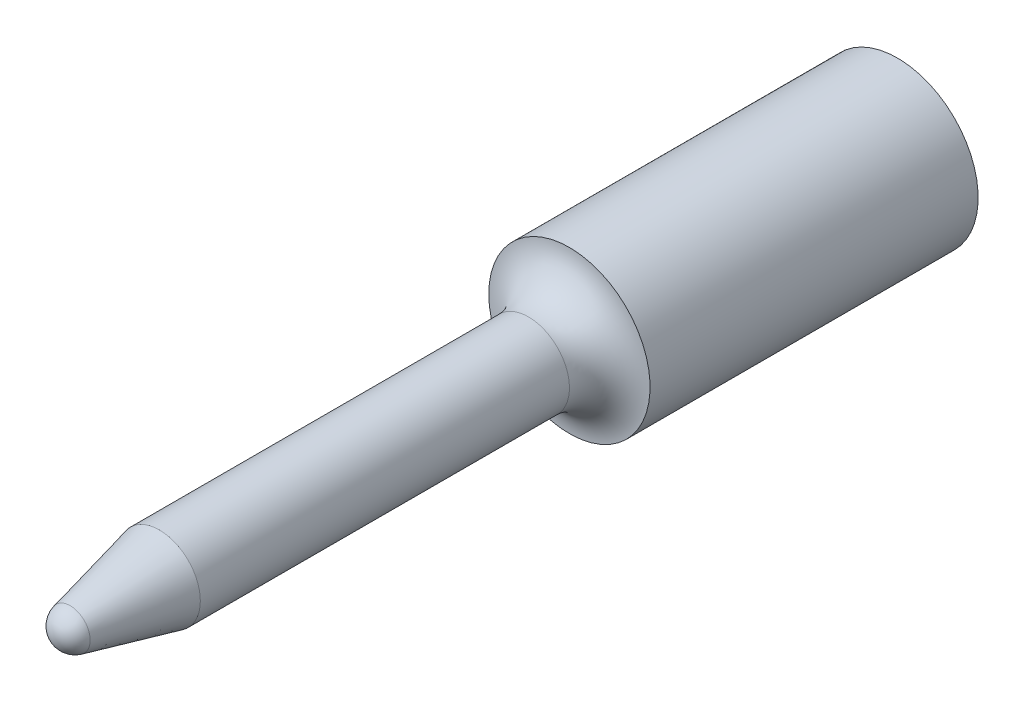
ISO-10303-21;
HEADER;
FILE_DESCRIPTION(('STEP AP214'),'2;1');
FILE_NAME('part.step','',(''),(''),'','','');
FILE_SCHEMA(('AUTOMOTIVE_DESIGN { 1 0 10303 214 1 1 1 1 }'));
ENDSEC;
DATA;
#1=APPLICATION_CONTEXT('core data for automotive mechanical design processes');
#2=APPLICATION_PROTOCOL_DEFINITION('international standard','automotive_design',2000,#1);
#3=PRODUCT_CONTEXT('',#1,'mechanical');
#4=PRODUCT('Part','Part','',(#3));
#5=PRODUCT_RELATED_PRODUCT_CATEGORY('part','',(#4));
#6=PRODUCT_DEFINITION_FORMATION('','',#4);
#7=PRODUCT_DEFINITION_CONTEXT('part definition',#1,'design');
#8=PRODUCT_DEFINITION('design','',#6,#7);
#9=PRODUCT_DEFINITION_SHAPE('','',#8);
#10=(LENGTH_UNIT() NAMED_UNIT(*) SI_UNIT(.MILLI.,.METRE.));
#11=(NAMED_UNIT(*) PLANE_ANGLE_UNIT() SI_UNIT($,.RADIAN.));
#12=(NAMED_UNIT(*) SI_UNIT($,.STERADIAN.) SOLID_ANGLE_UNIT());
#13=UNCERTAINTY_MEASURE_WITH_UNIT(LENGTH_MEASURE(1.E-05),#10,'distance_accuracy_value','');
#14=(GEOMETRIC_REPRESENTATION_CONTEXT(3) GLOBAL_UNCERTAINTY_ASSIGNED_CONTEXT((#13)) GLOBAL_UNIT_ASSIGNED_CONTEXT((#10,
#11,#12)) REPRESENTATION_CONTEXT('',''));
#15=CARTESIAN_POINT('',(0.,0.,0.));
#16=DIRECTION('',(0.,0.,1.));
#17=DIRECTION('',(1.,0.,0.));
#18=AXIS2_PLACEMENT_3D('',#15,#16,#17);
#19=CARTESIAN_POINT('',(0.,0.,15.));
#20=DIRECTION('',(0.,0.,-1.));
#21=DIRECTION('',(-1.,0.,0.));
#22=AXIS2_PLACEMENT_3D('',#19,#20,#21);
#23=CYLINDRICAL_SURFACE('',#22,1.5);
#24=CARTESIAN_POINT('',(0.,0.,1.4991664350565));
#25=DIRECTION('',(0.,0.,-1.));
#26=DIRECTION('',(-1.,0.,0.));
#27=AXIS2_PLACEMENT_3D('',#24,#25,#26);
#28=CIRCLE('',#27,1.5);
#29=CARTESIAN_POINT('',(-1.5,0.,1.4991664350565));
#30=VERTEX_POINT('',#29);
#31=EDGE_CURVE('E10',#30,#30,#28,.F.);
#32=ORIENTED_EDGE('',*,*,#31,.T.);
#33=EDGE_LOOP('',(#32));
#34=FACE_BOUND('',#33,.T.);
#35=CARTESIAN_POINT('',(0.,0.,15.));
#36=DIRECTION('',(0.,0.,1.));
#37=DIRECTION('',(1.,0.,0.));
#38=AXIS2_PLACEMENT_3D('',#35,#36,#37);
#39=CIRCLE('',#38,1.5);
#40=CARTESIAN_POINT('',(1.5,0.,15.));
#41=VERTEX_POINT('',#40);
#42=EDGE_CURVE('E38',#41,#41,#39,.T.);
#43=ORIENTED_EDGE('',*,*,#42,.F.);
#44=EDGE_LOOP('',(#43));
#45=FACE_BOUND('',#44,.T.);
#46=ADVANCED_FACE('F31',(#34,#45),#23,.T.);
#47=CARTESIAN_POINT('',(0.,0.,18.0862311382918));
#48=DIRECTION('',(0.,0.,-1.));
#49=DIRECTION('',(-1.,0.,0.));
#50=AXIS2_PLACEMENT_3D('',#47,#48,#49);
#51=SPHERICAL_SURFACE('',#50,0.750000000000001);
#52=CARTESIAN_POINT('',(0.,0.,18.2587208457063));
#53=DIRECTION('',(0.,0.,-1.));
#54=DIRECTION('',(-1.,0.,0.));
#55=AXIS2_PLACEMENT_3D('',#52,#53,#54);
#56=CIRCLE('',#55,0.729895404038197);
#57=CARTESIAN_POINT('',(-0.729895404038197,0.,18.2587208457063));
#58=VERTEX_POINT('',#57);
#59=EDGE_CURVE('E42',#58,#58,#56,.T.);
#60=ORIENTED_EDGE('',*,*,#59,.F.);
#61=EDGE_LOOP('',(#60));
#62=FACE_BOUND('',#61,.T.);
#63=ADVANCED_FACE('F71',(#62),#51,.T.);
#64=CARTESIAN_POINT('',(0.,0.,18.2587208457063));
#65=DIRECTION('',(0.,0.,-1.));
#66=DIRECTION('',(-1.,0.,0.));
#67=AXIS2_PLACEMENT_3D('',#64,#65,#66);
#68=CONICAL_SURFACE('',#67,0.729895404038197,0.232063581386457);
#69=ORIENTED_EDGE('',*,*,#42,.T.);
#70=EDGE_LOOP('',(#69));
#71=FACE_BOUND('',#70,.T.);
#72=ORIENTED_EDGE('',*,*,#59,.T.);
#73=EDGE_LOOP('',(#72));
#74=FACE_BOUND('',#73,.T.);
#75=ADVANCED_FACE('F60',(#71,#74),#68,.T.);
#76=CARTESIAN_POINT('',(0.,0.,-12.));
#77=DIRECTION('',(0.,0.,1.));
#78=DIRECTION('',(1.,0.,0.));
#79=AXIS2_PLACEMENT_3D('',#76,#77,#78);
#80=CYLINDRICAL_SURFACE('',#79,2.95);
#81=CARTESIAN_POINT('',(0.,0.,-12.));
#82=DIRECTION('',(0.,0.,-1.));
#83=DIRECTION('',(-1.,0.,0.));
#84=AXIS2_PLACEMENT_3D('',#81,#82,#83);
#85=CIRCLE('',#84,2.95);
#86=CARTESIAN_POINT('',(-2.95,0.,-12.));
#87=VERTEX_POINT('',#86);
#88=EDGE_CURVE('E46',#87,#87,#85,.T.);
#89=ORIENTED_EDGE('',*,*,#88,.F.);
#90=EDGE_LOOP('',(#89));
#91=FACE_BOUND('',#90,.T.);
#92=CARTESIAN_POINT('',(0.,0.,0.));
#93=DIRECTION('',(0.,0.,-1.));
#94=DIRECTION('',(-1.,0.,0.));
#95=AXIS2_PLACEMENT_3D('',#92,#93,#94);
#96=CIRCLE('',#95,2.95);
#97=CARTESIAN_POINT('',(-2.95,0.,0.));
#98=VERTEX_POINT('',#97);
#99=EDGE_CURVE('E49',#98,#98,#96,.T.);
#100=ORIENTED_EDGE('',*,*,#99,.T.);
#101=EDGE_LOOP('',(#100));
#102=FACE_BOUND('',#101,.T.);
#103=ADVANCED_FACE('F57',(#91,#102),#80,.T.);
#104=CARTESIAN_POINT('',(0.,0.,-12.));
#105=DIRECTION('',(0.,0.,-1.));
#106=DIRECTION('',(-1.,0.,0.));
#107=AXIS2_PLACEMENT_3D('',#104,#105,#106);
#108=PLANE('',#107);
#109=ORIENTED_EDGE('',*,*,#88,.T.);
#110=EDGE_LOOP('',(#109));
#111=FACE_BOUND('',#110,.T.);
#112=ADVANCED_FACE('F55',(#111),#108,.T.);
#113=CARTESIAN_POINT('',(0.,0.,1.4991664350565));
#114=DIRECTION('',(0.,0.,-1.));
#115=DIRECTION('',(-1.,0.,0.));
#116=AXIS2_PLACEMENT_3D('',#113,#114,#115);
#117=TOROIDAL_SURFACE('',#116,3.,1.5);
#118=ORIENTED_EDGE('',*,*,#31,.F.);
#119=EDGE_LOOP('',(#118));
#120=FACE_BOUND('',#119,.T.);
#121=ORIENTED_EDGE('',*,*,#99,.F.);
#122=EDGE_LOOP('',(#121));
#123=FACE_BOUND('',#122,.T.);
#124=ADVANCED_FACE('F33',(#120,#123),#117,.F.);
#125=CLOSED_SHELL('',(#46,#63,#75,#103,#112,#124));
#126=MANIFOLD_SOLID_BREP('B2',#125);
#127=ADVANCED_BREP_SHAPE_REPRESENTATION('',(#18,#126),#14);
#128=SHAPE_DEFINITION_REPRESENTATION(#9,#127);
ENDSEC;
END-ISO-10303-21;
